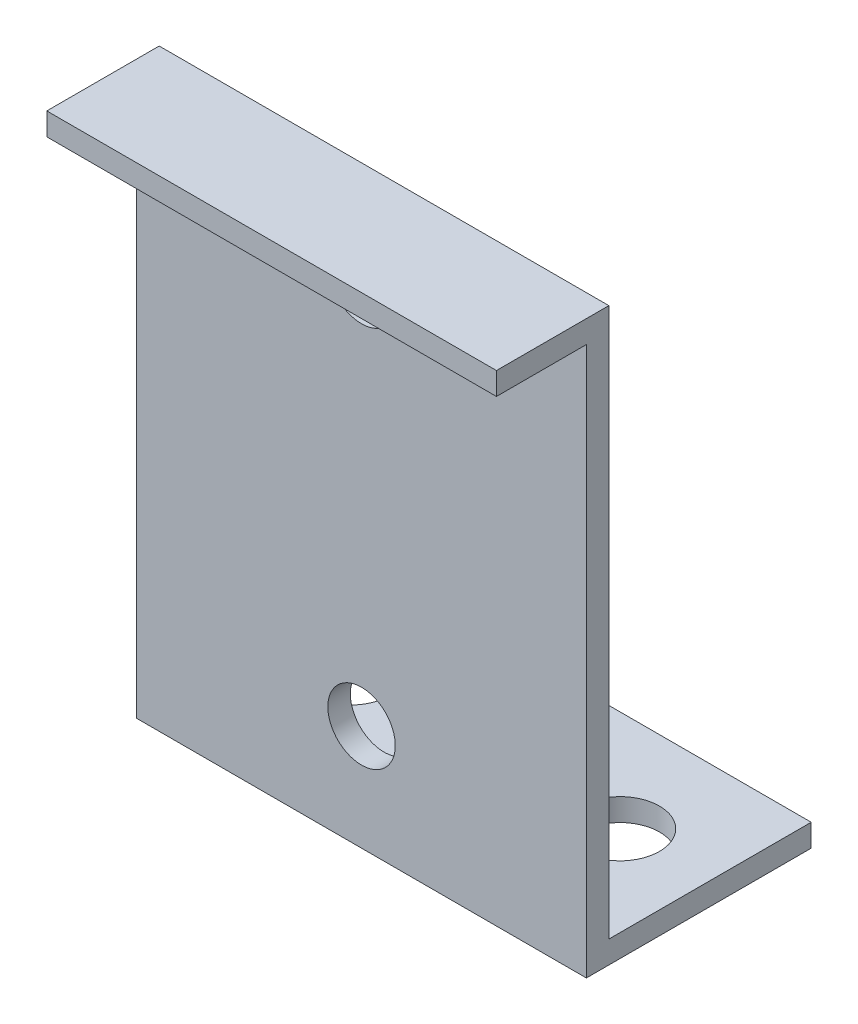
ISO-10303-21;
HEADER;
FILE_DESCRIPTION(('STEP AP214'),'2;1');
FILE_NAME('part.step','',(''),(''),'','','');
FILE_SCHEMA(('AUTOMOTIVE_DESIGN { 1 0 10303 214 1 1 1 1 }'));
ENDSEC;
DATA;
#1=APPLICATION_CONTEXT('core data for automotive mechanical design processes');
#2=APPLICATION_PROTOCOL_DEFINITION('international standard','automotive_design',2000,#1);
#3=PRODUCT_CONTEXT('',#1,'mechanical');
#4=PRODUCT('Part','Part','',(#3));
#5=PRODUCT_RELATED_PRODUCT_CATEGORY('part','',(#4));
#6=PRODUCT_DEFINITION_FORMATION('','',#4);
#7=PRODUCT_DEFINITION_CONTEXT('part definition',#1,'design');
#8=PRODUCT_DEFINITION('design','',#6,#7);
#9=PRODUCT_DEFINITION_SHAPE('','',#8);
#10=(LENGTH_UNIT() NAMED_UNIT(*) SI_UNIT(.MILLI.,.METRE.));
#11=(NAMED_UNIT(*) PLANE_ANGLE_UNIT() SI_UNIT($,.RADIAN.));
#12=(NAMED_UNIT(*) SI_UNIT($,.STERADIAN.) SOLID_ANGLE_UNIT());
#13=UNCERTAINTY_MEASURE_WITH_UNIT(LENGTH_MEASURE(1.E-05),#10,'distance_accuracy_value','');
#14=(GEOMETRIC_REPRESENTATION_CONTEXT(3) GLOBAL_UNCERTAINTY_ASSIGNED_CONTEXT((#13)) GLOBAL_UNIT_ASSIGNED_CONTEXT((#10,
#11,#12)) REPRESENTATION_CONTEXT('',''));
#15=CARTESIAN_POINT('',(0.,0.,0.));
#16=DIRECTION('',(0.,0.,1.));
#17=DIRECTION('',(1.,0.,0.));
#18=AXIS2_PLACEMENT_3D('',#15,#16,#17);
#19=CARTESIAN_POINT('',(20.,0.999999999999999,-10.));
#20=DIRECTION('',(0.,0.,1.));
#21=DIRECTION('',(1.,0.,0.));
#22=AXIS2_PLACEMENT_3D('',#19,#20,#21);
#23=PLANE('',#22);
#24=DIRECTION('',(0.,1.,0.));
#25=VECTOR('',#24,1.);
#26=CARTESIAN_POINT('',(0.,0.999999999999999,-10.));
#27=LINE('',#26,#25);
#28=CARTESIAN_POINT('',(0.,0.,-10.));
#29=VERTEX_POINT('',#28);
#30=CARTESIAN_POINT('',(0.,0.999999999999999,-10.));
#31=VERTEX_POINT('',#30);
#32=EDGE_CURVE('E131',#29,#31,#27,.T.);
#33=ORIENTED_EDGE('',*,*,#32,.T.);
#34=DIRECTION('',(-1.,0.,0.));
#35=VECTOR('',#34,1.);
#36=CARTESIAN_POINT('',(20.,0.999999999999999,-10.));
#37=LINE('',#36,#35);
#38=CARTESIAN_POINT('',(20.,0.999999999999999,-10.));
#39=VERTEX_POINT('',#38);
#40=EDGE_CURVE('E11',#39,#31,#37,.T.);
#41=ORIENTED_EDGE('',*,*,#40,.F.);
#42=DIRECTION('',(0.,1.,0.));
#43=VECTOR('',#42,1.);
#44=CARTESIAN_POINT('',(20.,0.999999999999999,-10.));
#45=LINE('',#44,#43);
#46=CARTESIAN_POINT('',(20.,0.,-10.));
#47=VERTEX_POINT('',#46);
#48=EDGE_CURVE('E146',#47,#39,#45,.T.);
#49=ORIENTED_EDGE('',*,*,#48,.F.);
#50=DIRECTION('',(-1.,0.,0.));
#51=VECTOR('',#50,1.);
#52=CARTESIAN_POINT('',(20.,0.,-10.));
#53=LINE('',#52,#51);
#54=EDGE_CURVE('E127',#47,#29,#53,.T.);
#55=ORIENTED_EDGE('',*,*,#54,.T.);
#56=EDGE_LOOP('',(#33,#41,#49,#55));
#57=FACE_BOUND('',#56,.T.);
#58=ADVANCED_FACE('F33',(#57),#23,.F.);
#59=CARTESIAN_POINT('',(20.,0.999999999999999,-10.));
#60=DIRECTION('',(0.,-1.,0.));
#61=DIRECTION('',(0.,0.,-1.));
#62=AXIS2_PLACEMENT_3D('',#59,#60,#61);
#63=PLANE('',#62);
#64=CARTESIAN_POINT('',(16.,1.,-5.5));
#65=DIRECTION('',(0.,1.,0.));
#66=DIRECTION('',(0.,0.,1.));
#67=AXIS2_PLACEMENT_3D('',#64,#65,#66);
#68=CIRCLE('',#67,1.75);
#69=CARTESIAN_POINT('',(16.,1.,-3.75));
#70=VERTEX_POINT('',#69);
#71=EDGE_CURVE('E163',#70,#70,#68,.T.);
#72=ORIENTED_EDGE('',*,*,#71,.F.);
#73=EDGE_LOOP('',(#72));
#74=FACE_BOUND('',#73,.T.);
#75=CARTESIAN_POINT('',(4.,1.,-5.5));
#76=DIRECTION('',(0.,1.,0.));
#77=DIRECTION('',(0.,0.,1.));
#78=AXIS2_PLACEMENT_3D('',#75,#76,#77);
#79=CIRCLE('',#78,1.75);
#80=CARTESIAN_POINT('',(4.,1.,-3.75));
#81=VERTEX_POINT('',#80);
#82=EDGE_CURVE('E160',#81,#81,#79,.T.);
#83=ORIENTED_EDGE('',*,*,#82,.F.);
#84=EDGE_LOOP('',(#83));
#85=FACE_BOUND('',#84,.T.);
#86=DIRECTION('',(0.,0.,1.));
#87=VECTOR('',#86,1.);
#88=CARTESIAN_POINT('',(0.,0.999999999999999,-10.));
#89=LINE('',#88,#87);
#90=CARTESIAN_POINT('',(0.,1.,-1.));
#91=VERTEX_POINT('',#90);
#92=EDGE_CURVE('E134',#31,#91,#89,.T.);
#93=ORIENTED_EDGE('',*,*,#92,.T.);
#94=DIRECTION('',(-1.,0.,0.));
#95=VECTOR('',#94,1.);
#96=CARTESIAN_POINT('',(20.,1.,-1.));
#97=LINE('',#96,#95);
#98=CARTESIAN_POINT('',(20.,1.,-1.));
#99=VERTEX_POINT('',#98);
#100=EDGE_CURVE('E42',#99,#91,#97,.T.);
#101=ORIENTED_EDGE('',*,*,#100,.F.);
#102=DIRECTION('',(0.,0.,1.));
#103=VECTOR('',#102,1.);
#104=CARTESIAN_POINT('',(20.,0.999999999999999,-10.));
#105=LINE('',#104,#103);
#106=EDGE_CURVE('E94',#39,#99,#105,.T.);
#107=ORIENTED_EDGE('',*,*,#106,.F.);
#108=ORIENTED_EDGE('',*,*,#40,.T.);
#109=EDGE_LOOP('',(#93,#101,#107,#108));
#110=FACE_BOUND('',#109,.T.);
#111=ADVANCED_FACE('F217',(#74,#85,#110),#63,.F.);
#112=CARTESIAN_POINT('',(20.,1.,-1.));
#113=DIRECTION('',(0.,0.,1.));
#114=DIRECTION('',(1.,0.,0.));
#115=AXIS2_PLACEMENT_3D('',#112,#113,#114);
#116=PLANE('',#115);
#117=CARTESIAN_POINT('',(10.,4.7,-1.));
#118=DIRECTION('',(0.,0.,-1.));
#119=DIRECTION('',(-1.,0.,0.));
#120=AXIS2_PLACEMENT_3D('',#117,#118,#119);
#121=CIRCLE('',#120,1.5);
#122=CARTESIAN_POINT('',(8.5,4.7,-1.));
#123=VERTEX_POINT('',#122);
#124=EDGE_CURVE('E176',#123,#123,#121,.T.);
#125=ORIENTED_EDGE('',*,*,#124,.F.);
#126=EDGE_LOOP('',(#125));
#127=FACE_BOUND('',#126,.T.);
#128=CARTESIAN_POINT('',(10.,21.7,-1.));
#129=DIRECTION('',(0.,0.,-1.));
#130=DIRECTION('',(-1.,0.,0.));
#131=AXIS2_PLACEMENT_3D('',#128,#129,#130);
#132=CIRCLE('',#131,1.5);
#133=CARTESIAN_POINT('',(8.5,21.7,-1.));
#134=VERTEX_POINT('',#133);
#135=EDGE_CURVE('E166',#134,#134,#132,.T.);
#136=ORIENTED_EDGE('',*,*,#135,.F.);
#137=EDGE_LOOP('',(#136));
#138=FACE_BOUND('',#137,.T.);
#139=DIRECTION('',(0.,1.,0.));
#140=VECTOR('',#139,1.);
#141=CARTESIAN_POINT('',(0.,1.,-1.));
#142=LINE('',#141,#140);
#143=CARTESIAN_POINT('',(0.,25.4,-1.));
#144=VERTEX_POINT('',#143);
#145=EDGE_CURVE('E137',#91,#144,#142,.T.);
#146=ORIENTED_EDGE('',*,*,#145,.T.);
#147=DIRECTION('',(-1.,0.,0.));
#148=VECTOR('',#147,1.);
#149=CARTESIAN_POINT('',(20.,25.4,-1.));
#150=LINE('',#149,#148);
#151=CARTESIAN_POINT('',(20.,25.4,-1.));
#152=VERTEX_POINT('',#151);
#153=EDGE_CURVE('E153',#152,#144,#150,.T.);
#154=ORIENTED_EDGE('',*,*,#153,.F.);
#155=DIRECTION('',(0.,1.,0.));
#156=VECTOR('',#155,1.);
#157=CARTESIAN_POINT('',(20.,1.,-1.));
#158=LINE('',#157,#156);
#159=EDGE_CURVE('E183',#99,#152,#158,.T.);
#160=ORIENTED_EDGE('',*,*,#159,.F.);
#161=ORIENTED_EDGE('',*,*,#100,.T.);
#162=EDGE_LOOP('',(#146,#154,#160,#161));
#163=FACE_BOUND('',#162,.T.);
#164=ADVANCED_FACE('F221',(#127,#138,#163),#116,.F.);
#165=CARTESIAN_POINT('',(20.,25.4,-1.));
#166=DIRECTION('',(0.,-1.,0.));
#167=DIRECTION('',(0.,0.,-1.));
#168=AXIS2_PLACEMENT_3D('',#165,#166,#167);
#169=PLANE('',#168);
#170=DIRECTION('',(0.,0.,1.));
#171=VECTOR('',#170,1.);
#172=CARTESIAN_POINT('',(0.,25.4,-1.));
#173=LINE('',#172,#171);
#174=CARTESIAN_POINT('',(0.,25.4,4.));
#175=VERTEX_POINT('',#174);
#176=EDGE_CURVE('E139',#144,#175,#173,.T.);
#177=ORIENTED_EDGE('',*,*,#176,.T.);
#178=DIRECTION('',(-1.,0.,0.));
#179=VECTOR('',#178,1.);
#180=CARTESIAN_POINT('',(20.,25.4,4.));
#181=LINE('',#180,#179);
#182=CARTESIAN_POINT('',(20.,25.4,4.));
#183=VERTEX_POINT('',#182);
#184=EDGE_CURVE('E150',#183,#175,#181,.T.);
#185=ORIENTED_EDGE('',*,*,#184,.F.);
#186=DIRECTION('',(0.,0.,1.));
#187=VECTOR('',#186,1.);
#188=CARTESIAN_POINT('',(20.,25.4,-1.));
#189=LINE('',#188,#187);
#190=EDGE_CURVE('E185',#152,#183,#189,.T.);
#191=ORIENTED_EDGE('',*,*,#190,.F.);
#192=ORIENTED_EDGE('',*,*,#153,.T.);
#193=EDGE_LOOP('',(#177,#185,#191,#192));
#194=FACE_BOUND('',#193,.T.);
#195=ADVANCED_FACE('F191',(#194),#169,.F.);
#196=CARTESIAN_POINT('',(20.,25.4,4.));
#197=DIRECTION('',(0.,0.,-1.));
#198=DIRECTION('',(-1.,0.,0.));
#199=AXIS2_PLACEMENT_3D('',#196,#197,#198);
#200=PLANE('',#199);
#201=DIRECTION('',(0.,-1.,0.));
#202=VECTOR('',#201,1.);
#203=CARTESIAN_POINT('',(0.,25.4,4.));
#204=LINE('',#203,#202);
#205=CARTESIAN_POINT('',(0.,24.4,4.));
#206=VERTEX_POINT('',#205);
#207=EDGE_CURVE('E141',#175,#206,#204,.T.);
#208=ORIENTED_EDGE('',*,*,#207,.T.);
#209=DIRECTION('',(-1.,0.,0.));
#210=VECTOR('',#209,1.);
#211=CARTESIAN_POINT('',(20.,24.4,4.));
#212=LINE('',#211,#210);
#213=CARTESIAN_POINT('',(20.,24.4,4.));
#214=VERTEX_POINT('',#213);
#215=EDGE_CURVE('E122',#214,#206,#212,.T.);
#216=ORIENTED_EDGE('',*,*,#215,.F.);
#217=DIRECTION('',(0.,-1.,0.));
#218=VECTOR('',#217,1.);
#219=CARTESIAN_POINT('',(20.,25.4,4.));
#220=LINE('',#219,#218);
#221=EDGE_CURVE('E113',#183,#214,#220,.T.);
#222=ORIENTED_EDGE('',*,*,#221,.F.);
#223=ORIENTED_EDGE('',*,*,#184,.T.);
#224=EDGE_LOOP('',(#208,#216,#222,#223));
#225=FACE_BOUND('',#224,.T.);
#226=ADVANCED_FACE('F195',(#225),#200,.F.);
#227=CARTESIAN_POINT('',(20.,24.4,0.));
#228=DIRECTION('',(0.,1.,0.));
#229=DIRECTION('',(0.,0.,1.));
#230=AXIS2_PLACEMENT_3D('',#227,#228,#229);
#231=PLANE('',#230);
#232=DIRECTION('',(0.,0.,-1.));
#233=VECTOR('',#232,1.);
#234=CARTESIAN_POINT('',(0.,24.4,0.));
#235=LINE('',#234,#233);
#236=CARTESIAN_POINT('',(0.,24.4,0.));
#237=VERTEX_POINT('',#236);
#238=EDGE_CURVE('E121',#206,#237,#235,.T.);
#239=ORIENTED_EDGE('',*,*,#238,.T.);
#240=DIRECTION('',(-1.,0.,0.));
#241=VECTOR('',#240,1.);
#242=CARTESIAN_POINT('',(20.,24.4,0.));
#243=LINE('',#242,#241);
#244=CARTESIAN_POINT('',(20.,24.4,0.));
#245=VERTEX_POINT('',#244);
#246=EDGE_CURVE('E118',#245,#237,#243,.T.);
#247=ORIENTED_EDGE('',*,*,#246,.F.);
#248=DIRECTION('',(0.,0.,-1.));
#249=VECTOR('',#248,1.);
#250=CARTESIAN_POINT('',(20.,24.4,0.));
#251=LINE('',#250,#249);
#252=EDGE_CURVE('E107',#214,#245,#251,.T.);
#253=ORIENTED_EDGE('',*,*,#252,.F.);
#254=ORIENTED_EDGE('',*,*,#215,.T.);
#255=EDGE_LOOP('',(#239,#247,#253,#254));
#256=FACE_BOUND('',#255,.T.);
#257=ADVANCED_FACE('F119',(#256),#231,.F.);
#258=CARTESIAN_POINT('',(20.,0.,0.));
#259=DIRECTION('',(0.,0.,-1.));
#260=DIRECTION('',(-1.,0.,0.));
#261=AXIS2_PLACEMENT_3D('',#258,#259,#260);
#262=PLANE('',#261);
#263=CARTESIAN_POINT('',(10.,4.7,0.));
#264=DIRECTION('',(0.,0.,-1.));
#265=DIRECTION('',(-1.,0.,0.));
#266=AXIS2_PLACEMENT_3D('',#263,#264,#265);
#267=CIRCLE('',#266,1.5);
#268=CARTESIAN_POINT('',(8.5,4.7,0.));
#269=VERTEX_POINT('',#268);
#270=EDGE_CURVE('E36',#269,#269,#267,.T.);
#271=ORIENTED_EDGE('',*,*,#270,.T.);
#272=EDGE_LOOP('',(#271));
#273=FACE_BOUND('',#272,.T.);
#274=CARTESIAN_POINT('',(10.,21.7,0.));
#275=DIRECTION('',(0.,0.,-1.));
#276=DIRECTION('',(-1.,0.,0.));
#277=AXIS2_PLACEMENT_3D('',#274,#275,#276);
#278=CIRCLE('',#277,1.5);
#279=CARTESIAN_POINT('',(8.5,21.7,0.));
#280=VERTEX_POINT('',#279);
#281=EDGE_CURVE('E164',#280,#280,#278,.T.);
#282=ORIENTED_EDGE('',*,*,#281,.T.);
#283=EDGE_LOOP('',(#282));
#284=FACE_BOUND('',#283,.T.);
#285=DIRECTION('',(0.,-1.,0.));
#286=VECTOR('',#285,1.);
#287=CARTESIAN_POINT('',(0.,0.,0.));
#288=LINE('',#287,#286);
#289=CARTESIAN_POINT('',(0.,0.,0.));
#290=VERTEX_POINT('',#289);
#291=EDGE_CURVE('E80',#237,#290,#288,.T.);
#292=ORIENTED_EDGE('',*,*,#291,.T.);
#293=DIRECTION('',(-1.,0.,0.));
#294=VECTOR('',#293,1.);
#295=CARTESIAN_POINT('',(20.,0.,0.));
#296=LINE('',#295,#294);
#297=CARTESIAN_POINT('',(20.,0.,0.));
#298=VERTEX_POINT('',#297);
#299=EDGE_CURVE('E123',#298,#290,#296,.T.);
#300=ORIENTED_EDGE('',*,*,#299,.F.);
#301=DIRECTION('',(0.,-1.,0.));
#302=VECTOR('',#301,1.);
#303=CARTESIAN_POINT('',(20.,0.,0.));
#304=LINE('',#303,#302);
#305=EDGE_CURVE('E111',#245,#298,#304,.T.);
#306=ORIENTED_EDGE('',*,*,#305,.F.);
#307=ORIENTED_EDGE('',*,*,#246,.T.);
#308=EDGE_LOOP('',(#292,#300,#306,#307));
#309=FACE_BOUND('',#308,.T.);
#310=ADVANCED_FACE('F125',(#273,#284,#309),#262,.F.);
#311=CARTESIAN_POINT('',(20.,0.,-10.));
#312=DIRECTION('',(0.,1.,0.));
#313=DIRECTION('',(0.,0.,1.));
#314=AXIS2_PLACEMENT_3D('',#311,#312,#313);
#315=PLANE('',#314);
#316=CARTESIAN_POINT('',(16.,0.,-5.5));
#317=DIRECTION('',(0.,1.,0.));
#318=DIRECTION('',(0.,0.,1.));
#319=AXIS2_PLACEMENT_3D('',#316,#317,#318);
#320=CIRCLE('',#319,1.75);
#321=CARTESIAN_POINT('',(16.,0.,-3.75));
#322=VERTEX_POINT('',#321);
#323=EDGE_CURVE('E161',#322,#322,#320,.T.);
#324=ORIENTED_EDGE('',*,*,#323,.T.);
#325=EDGE_LOOP('',(#324));
#326=FACE_BOUND('',#325,.T.);
#327=CARTESIAN_POINT('',(4.,0.,-5.5));
#328=DIRECTION('',(0.,1.,0.));
#329=DIRECTION('',(0.,0.,1.));
#330=AXIS2_PLACEMENT_3D('',#327,#328,#329);
#331=CIRCLE('',#330,1.75);
#332=CARTESIAN_POINT('',(4.,0.,-3.75));
#333=VERTEX_POINT('',#332);
#334=EDGE_CURVE('E135',#333,#333,#331,.T.);
#335=ORIENTED_EDGE('',*,*,#334,.T.);
#336=EDGE_LOOP('',(#335));
#337=FACE_BOUND('',#336,.T.);
#338=DIRECTION('',(0.,0.,-1.));
#339=VECTOR('',#338,1.);
#340=CARTESIAN_POINT('',(0.,0.,-10.));
#341=LINE('',#340,#339);
#342=EDGE_CURVE('E86',#290,#29,#341,.T.);
#343=ORIENTED_EDGE('',*,*,#342,.T.);
#344=ORIENTED_EDGE('',*,*,#54,.F.);
#345=DIRECTION('',(0.,0.,-1.));
#346=VECTOR('',#345,1.);
#347=CARTESIAN_POINT('',(20.,0.,-10.));
#348=LINE('',#347,#346);
#349=EDGE_CURVE('E51',#298,#47,#348,.T.);
#350=ORIENTED_EDGE('',*,*,#349,.F.);
#351=ORIENTED_EDGE('',*,*,#299,.T.);
#352=EDGE_LOOP('',(#343,#344,#350,#351));
#353=FACE_BOUND('',#352,.T.);
#354=ADVANCED_FACE('F203',(#326,#337,#353),#315,.F.);
#355=CARTESIAN_POINT('',(20.,0.,-10.));
#356=DIRECTION('',(-1.,0.,0.));
#357=DIRECTION('',(0.,0.,1.));
#358=AXIS2_PLACEMENT_3D('',#355,#356,#357);
#359=PLANE('',#358);
#360=ORIENTED_EDGE('',*,*,#48,.T.);
#361=ORIENTED_EDGE('',*,*,#106,.T.);
#362=ORIENTED_EDGE('',*,*,#159,.T.);
#363=ORIENTED_EDGE('',*,*,#190,.T.);
#364=ORIENTED_EDGE('',*,*,#221,.T.);
#365=ORIENTED_EDGE('',*,*,#252,.T.);
#366=ORIENTED_EDGE('',*,*,#305,.T.);
#367=ORIENTED_EDGE('',*,*,#349,.T.);
#368=EDGE_LOOP('',(#360,#361,#362,#363,#364,#365,#366,#367));
#369=FACE_BOUND('',#368,.T.);
#370=ADVANCED_FACE('F109',(#369),#359,.F.);
#371=CARTESIAN_POINT('',(0.,0.,-10.));
#372=DIRECTION('',(-1.,0.,0.));
#373=DIRECTION('',(0.,0.,1.));
#374=AXIS2_PLACEMENT_3D('',#371,#372,#373);
#375=PLANE('',#374);
#376=ORIENTED_EDGE('',*,*,#32,.F.);
#377=ORIENTED_EDGE('',*,*,#342,.F.);
#378=ORIENTED_EDGE('',*,*,#291,.F.);
#379=ORIENTED_EDGE('',*,*,#238,.F.);
#380=ORIENTED_EDGE('',*,*,#207,.F.);
#381=ORIENTED_EDGE('',*,*,#176,.F.);
#382=ORIENTED_EDGE('',*,*,#145,.F.);
#383=ORIENTED_EDGE('',*,*,#92,.F.);
#384=EDGE_LOOP('',(#376,#377,#378,#379,#380,#381,#382,#383));
#385=FACE_BOUND('',#384,.T.);
#386=ADVANCED_FACE('F198',(#385),#375,.T.);
#387=CARTESIAN_POINT('',(4.,-19.,-5.5));
#388=DIRECTION('',(0.,1.,0.));
#389=DIRECTION('',(0.,0.,1.));
#390=AXIS2_PLACEMENT_3D('',#387,#388,#389);
#391=CYLINDRICAL_SURFACE('',#390,1.75);
#392=ORIENTED_EDGE('',*,*,#82,.T.);
#393=EDGE_LOOP('',(#392));
#394=FACE_BOUND('',#393,.T.);
#395=ORIENTED_EDGE('',*,*,#334,.F.);
#396=EDGE_LOOP('',(#395));
#397=FACE_BOUND('',#396,.T.);
#398=ADVANCED_FACE('F280',(#394,#397),#391,.F.);
#399=CARTESIAN_POINT('',(16.,-19.,-5.5));
#400=DIRECTION('',(0.,1.,0.));
#401=DIRECTION('',(0.,0.,1.));
#402=AXIS2_PLACEMENT_3D('',#399,#400,#401);
#403=CYLINDRICAL_SURFACE('',#402,1.75);
#404=ORIENTED_EDGE('',*,*,#71,.T.);
#405=EDGE_LOOP('',(#404));
#406=FACE_BOUND('',#405,.T.);
#407=ORIENTED_EDGE('',*,*,#323,.F.);
#408=EDGE_LOOP('',(#407));
#409=FACE_BOUND('',#408,.T.);
#410=ADVANCED_FACE('F261',(#406,#409),#403,.F.);
#411=CARTESIAN_POINT('',(10.,21.7,19.));
#412=DIRECTION('',(0.,0.,-1.));
#413=DIRECTION('',(-1.,0.,0.));
#414=AXIS2_PLACEMENT_3D('',#411,#412,#413);
#415=CYLINDRICAL_SURFACE('',#414,1.5);
#416=ORIENTED_EDGE('',*,*,#135,.T.);
#417=EDGE_LOOP('',(#416));
#418=FACE_BOUND('',#417,.T.);
#419=ORIENTED_EDGE('',*,*,#281,.F.);
#420=EDGE_LOOP('',(#419));
#421=FACE_BOUND('',#420,.T.);
#422=ADVANCED_FACE('F255',(#418,#421),#415,.F.);
#423=CARTESIAN_POINT('',(10.,4.7,19.));
#424=DIRECTION('',(0.,0.,-1.));
#425=DIRECTION('',(-1.,0.,0.));
#426=AXIS2_PLACEMENT_3D('',#423,#424,#425);
#427=CYLINDRICAL_SURFACE('',#426,1.5);
#428=ORIENTED_EDGE('',*,*,#124,.T.);
#429=EDGE_LOOP('',(#428));
#430=FACE_BOUND('',#429,.T.);
#431=ORIENTED_EDGE('',*,*,#270,.F.);
#432=EDGE_LOOP('',(#431));
#433=FACE_BOUND('',#432,.T.);
#434=ADVANCED_FACE('F260',(#430,#433),#427,.F.);
#435=CLOSED_SHELL('',(#58,#111,#164,#195,#226,#257,#310,#354,#370,#386,#398,#410,#422,#434));
#436=MANIFOLD_SOLID_BREP('B2',#435);
#437=ADVANCED_BREP_SHAPE_REPRESENTATION('',(#18,#436),#14);
#438=SHAPE_DEFINITION_REPRESENTATION(#9,#437);
ENDSEC;
END-ISO-10303-21;
